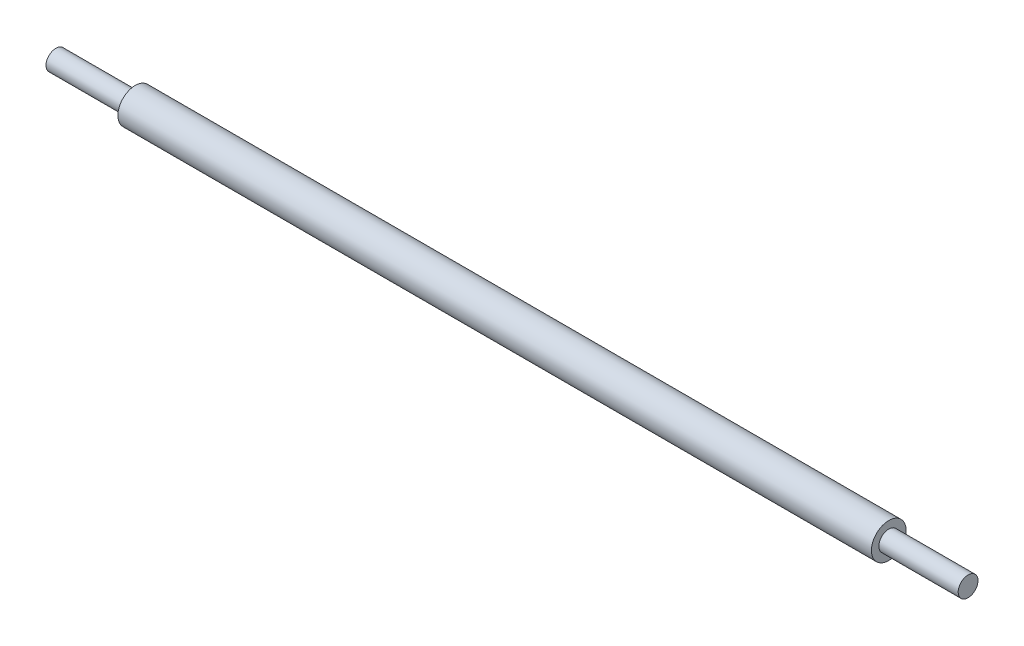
from build123d import *


with BuildPart() as part:
    # Esquisse1 → R_volution1 (revolve)
    with BuildSketch(Plane.XY):
        Polygon((-460, 0), (-460, 10), (-380, 10), (-380, 17.5), (380, 17.5), (380, 10), (460, 10), (460, 0), align=None)
    revolve(axis=Axis((-460, 0, 0), (-1, 0, 0)))


solid = part.part
